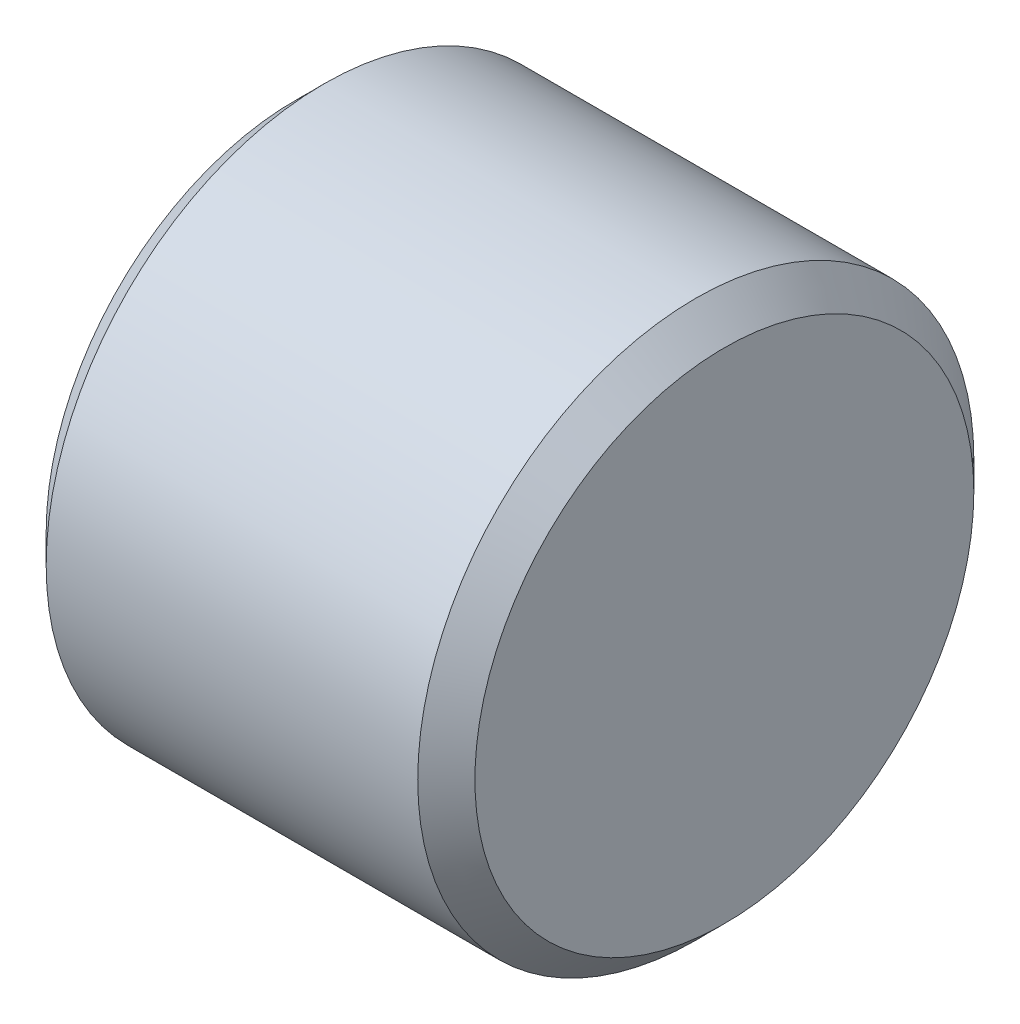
from build123d import *

# Parameters (mm, degrees)
SKETCH_1_W          = 7.5
SKETCH_1_H          = 4.864
SKETCH_2_R          = 0.6
CUT_EXTRUDE_1_DEPTH = 2
CHAMFER_1_SIZE      = 0.5


with BuildPart() as part:
    # Sketch 1 → Revolve 1 (revolve)
    with BuildSketch(Plane.XY, mode=Mode.PRIVATE) as revolve_1_sk:
        with Locations((-3.75, 2.432)):
            Rectangle(SKETCH_1_W, SKETCH_1_H)
    revolve(revolve_1_sk.sketch.rotate(Axis((0, 0, 0), (-1, 0, 0)), 90), axis=Axis((0, 0, 0), (-1, 0, 0)))

    # Sketch 2 → Cut-Extrude 1 (cut)
    with BuildSketch(Plane.ZY.offset(7.5)):
        with Locations((0.069279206, 0)):
            Circle(SKETCH_2_R)
    extrude(amount=-CUT_EXTRUDE_1_DEPTH, mode=Mode.SUBTRACT)

    # Chamfer 1
    chamfer_1_edges = [part.edges().sort_by_distance(p)[0] for p in [
        (-7.5, 0, 4.864),
        (0, 0, 4.864),
    ]]
    chamfer(chamfer_1_edges, length=CHAMFER_1_SIZE)


solid = part.part
